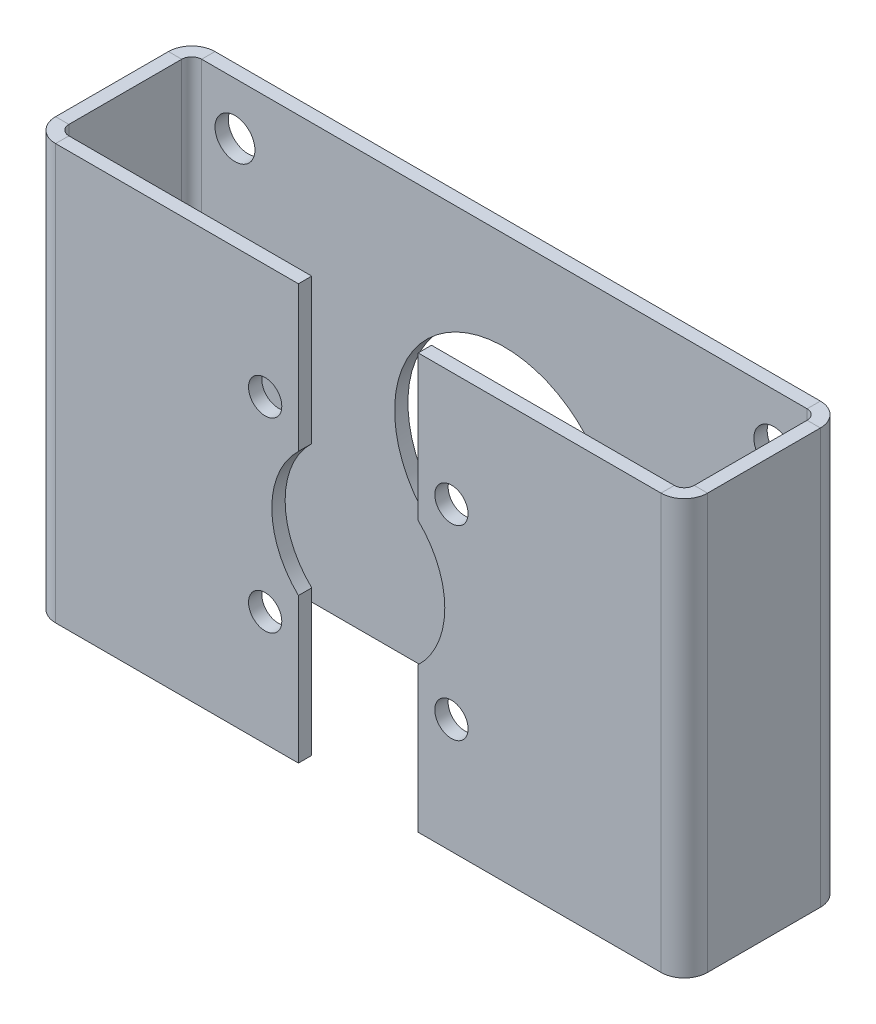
ISO-10303-21;
HEADER;
FILE_DESCRIPTION(('STEP AP214'),'2;1');
FILE_NAME('part.step','',(''),(''),'','','');
FILE_SCHEMA(('AUTOMOTIVE_DESIGN { 1 0 10303 214 1 1 1 1 }'));
ENDSEC;
DATA;
#1=APPLICATION_CONTEXT('core data for automotive mechanical design processes');
#2=APPLICATION_PROTOCOL_DEFINITION('international standard','automotive_design',2000,#1);
#3=PRODUCT_CONTEXT('',#1,'mechanical');
#4=PRODUCT('Part','Part','',(#3));
#5=PRODUCT_RELATED_PRODUCT_CATEGORY('part','',(#4));
#6=PRODUCT_DEFINITION_FORMATION('','',#4);
#7=PRODUCT_DEFINITION_CONTEXT('part definition',#1,'design');
#8=PRODUCT_DEFINITION('design','',#6,#7);
#9=PRODUCT_DEFINITION_SHAPE('','',#8);
#10=(LENGTH_UNIT() NAMED_UNIT(*) SI_UNIT(.MILLI.,.METRE.));
#11=(NAMED_UNIT(*) PLANE_ANGLE_UNIT() SI_UNIT($,.RADIAN.));
#12=(NAMED_UNIT(*) SI_UNIT($,.STERADIAN.) SOLID_ANGLE_UNIT());
#13=UNCERTAINTY_MEASURE_WITH_UNIT(LENGTH_MEASURE(1.E-05),#10,'distance_accuracy_value','');
#14=(GEOMETRIC_REPRESENTATION_CONTEXT(3) GLOBAL_UNCERTAINTY_ASSIGNED_CONTEXT((#13)) GLOBAL_UNIT_ASSIGNED_CONTEXT((#10,
#11,#12)) REPRESENTATION_CONTEXT('',''));
#15=CARTESIAN_POINT('',(0.,0.,0.));
#16=DIRECTION('',(0.,0.,1.));
#17=DIRECTION('',(1.,0.,0.));
#18=AXIS2_PLACEMENT_3D('',#15,#16,#17);
#19=CARTESIAN_POINT('',(-149.225,-99.06,76.073));
#20=DIRECTION('',(0.,0.,1.));
#21=DIRECTION('',(1.,0.,0.));
#22=AXIS2_PLACEMENT_3D('',#19,#20,#21);
#23=PLANE('',#22);
#24=CARTESIAN_POINT('',(-44.4500000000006,44.45,76.0730000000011));
#25=DIRECTION('',(0.,0.,1.));
#26=DIRECTION('',(1.,0.,0.));
#27=AXIS2_PLACEMENT_3D('',#24,#25,#26);
#28=CIRCLE('',#27,7.9375);
#29=CARTESIAN_POINT('',(-36.5125000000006,44.45,76.0730000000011));
#30=VERTEX_POINT('',#29);
#31=EDGE_CURVE('E615',#30,#30,#28,.T.);
#32=ORIENTED_EDGE('',*,*,#31,.F.);
#33=EDGE_LOOP('',(#32));
#34=FACE_BOUND('',#33,.T.);
#35=CARTESIAN_POINT('',(-44.4500000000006,-44.45,76.0730000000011));
#36=DIRECTION('',(0.,0.,1.));
#37=DIRECTION('',(1.,0.,0.));
#38=AXIS2_PLACEMENT_3D('',#35,#36,#37);
#39=CIRCLE('',#38,7.9375);
#40=CARTESIAN_POINT('',(-36.5125000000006,-44.45,76.0730000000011));
#41=VERTEX_POINT('',#40);
#42=EDGE_CURVE('E621',#41,#41,#39,.T.);
#43=ORIENTED_EDGE('',*,*,#42,.F.);
#44=EDGE_LOOP('',(#43));
#45=FACE_BOUND('',#44,.T.);
#46=DIRECTION('',(0.,-1.,0.));
#47=VECTOR('',#46,1.);
#48=CARTESIAN_POINT('',(-28.5750000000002,-99.06,76.0730000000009));
#49=LINE('',#48,#47);
#50=CARTESIAN_POINT('',(-28.5750000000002,-99.06,76.0730000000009));
#51=VERTEX_POINT('',#50);
#52=CARTESIAN_POINT('',(-28.5750000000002,-29.784140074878,76.0730000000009));
#53=VERTEX_POINT('',#52);
#54=EDGE_CURVE('E470',#51,#53,#49,.F.);
#55=ORIENTED_EDGE('',*,*,#54,.T.);
#56=CARTESIAN_POINT('',(5.53095581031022E-13,0.,76.0730000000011));
#57=DIRECTION('',(0.,0.,1.));
#58=DIRECTION('',(1.,0.,0.));
#59=AXIS2_PLACEMENT_3D('',#56,#57,#58);
#60=CIRCLE('',#59,41.275);
#61=CARTESIAN_POINT('',(-28.5750000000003,29.7841400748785,76.0730000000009));
#62=VERTEX_POINT('',#61);
#63=EDGE_CURVE('E275',#62,#53,#60,.T.);
#64=ORIENTED_EDGE('',*,*,#63,.F.);
#65=CARTESIAN_POINT('',(-28.5750000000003,99.0600000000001,76.0730000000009));
#66=VERTEX_POINT('',#65);
#67=EDGE_CURVE('E471',#62,#66,#49,.F.);
#68=ORIENTED_EDGE('',*,*,#67,.T.);
#69=DIRECTION('',(1.,0.,0.));
#70=VECTOR('',#69,1.);
#71=CARTESIAN_POINT('',(-149.225,99.06,76.073));
#72=LINE('',#71,#70);
#73=CARTESIAN_POINT('',(-144.4625,99.06,76.073));
#74=VERTEX_POINT('',#73);
#75=EDGE_CURVE('E467',#66,#74,#72,.F.);
#76=ORIENTED_EDGE('',*,*,#75,.T.);
#77=DIRECTION('',(0.,-1.,0.));
#78=VECTOR('',#77,1.);
#79=CARTESIAN_POINT('',(-144.4625,-99.06,76.073));
#80=LINE('',#79,#78);
#81=CARTESIAN_POINT('',(-144.4625,-99.06,76.073));
#82=VERTEX_POINT('',#81);
#83=EDGE_CURVE('E304',#74,#82,#80,.T.);
#84=ORIENTED_EDGE('',*,*,#83,.T.);
#85=DIRECTION('',(-1.,0.,0.));
#86=VECTOR('',#85,1.);
#87=CARTESIAN_POINT('',(-149.225,-99.06,76.073));
#88=LINE('',#87,#86);
#89=EDGE_CURVE('E298',#82,#51,#88,.F.);
#90=ORIENTED_EDGE('',*,*,#89,.T.);
#91=EDGE_LOOP('',(#55,#64,#68,#76,#84,#90));
#92=FACE_BOUND('',#91,.T.);
#93=ADVANCED_FACE('F112',(#34,#45,#92),#23,.T.);
#94=CARTESIAN_POINT('',(-149.225,-99.06,69.723));
#95=DIRECTION('',(0.,0.,1.));
#96=DIRECTION('',(1.,0.,0.));
#97=AXIS2_PLACEMENT_3D('',#94,#95,#96);
#98=PLANE('',#97);
#99=CARTESIAN_POINT('',(-44.4500000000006,44.45,69.7230000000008));
#100=DIRECTION('',(0.,0.,1.));
#101=DIRECTION('',(1.,0.,0.));
#102=AXIS2_PLACEMENT_3D('',#99,#100,#101);
#103=CIRCLE('',#102,7.9375);
#104=CARTESIAN_POINT('',(-36.5125000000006,44.45,69.7230000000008));
#105=VERTEX_POINT('',#104);
#106=EDGE_CURVE('E582',#105,#105,#103,.F.);
#107=ORIENTED_EDGE('',*,*,#106,.F.);
#108=EDGE_LOOP('',(#107));
#109=FACE_BOUND('',#108,.T.);
#110=CARTESIAN_POINT('',(-44.4500000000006,-44.45,69.7230000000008));
#111=DIRECTION('',(0.,0.,1.));
#112=DIRECTION('',(1.,0.,0.));
#113=AXIS2_PLACEMENT_3D('',#110,#111,#112);
#114=CIRCLE('',#113,7.9375);
#115=CARTESIAN_POINT('',(-36.5125000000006,-44.45,69.7230000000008));
#116=VERTEX_POINT('',#115);
#117=EDGE_CURVE('E618',#116,#116,#114,.F.);
#118=ORIENTED_EDGE('',*,*,#117,.F.);
#119=EDGE_LOOP('',(#118));
#120=FACE_BOUND('',#119,.T.);
#121=CARTESIAN_POINT('',(5.98380993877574E-13,0.,69.7230000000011));
#122=DIRECTION('',(0.,0.,1.));
#123=DIRECTION('',(1.,0.,0.));
#124=AXIS2_PLACEMENT_3D('',#121,#122,#123);
#125=CIRCLE('',#124,41.275);
#126=CARTESIAN_POINT('',(-28.5750000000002,29.7841400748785,69.7230000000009));
#127=VERTEX_POINT('',#126);
#128=CARTESIAN_POINT('',(-28.5750000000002,-29.784140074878,69.7230000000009));
#129=VERTEX_POINT('',#128);
#130=EDGE_CURVE('E129',#127,#129,#125,.T.);
#131=ORIENTED_EDGE('',*,*,#130,.T.);
#132=DIRECTION('',(0.,1.,0.));
#133=VECTOR('',#132,1.);
#134=CARTESIAN_POINT('',(-28.5750000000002,-99.06,69.7230000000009));
#135=LINE('',#134,#133);
#136=CARTESIAN_POINT('',(-28.5750000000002,-99.06,69.7230000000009));
#137=VERTEX_POINT('',#136);
#138=EDGE_CURVE('E287',#137,#129,#135,.T.);
#139=ORIENTED_EDGE('',*,*,#138,.F.);
#140=DIRECTION('',(1.,0.,0.));
#141=VECTOR('',#140,1.);
#142=CARTESIAN_POINT('',(-149.225,-99.06,69.723));
#143=LINE('',#142,#141);
#144=CARTESIAN_POINT('',(-144.4625,-99.06,69.723));
#145=VERTEX_POINT('',#144);
#146=EDGE_CURVE('E300',#145,#137,#143,.T.);
#147=ORIENTED_EDGE('',*,*,#146,.F.);
#148=DIRECTION('',(0.,1.,0.));
#149=VECTOR('',#148,1.);
#150=CARTESIAN_POINT('',(-144.4625,99.06,69.723));
#151=LINE('',#150,#149);
#152=CARTESIAN_POINT('',(-144.4625,99.06,69.723));
#153=VERTEX_POINT('',#152);
#154=EDGE_CURVE('E310',#153,#145,#151,.F.);
#155=ORIENTED_EDGE('',*,*,#154,.F.);
#156=DIRECTION('',(-1.,0.,0.));
#157=VECTOR('',#156,1.);
#158=CARTESIAN_POINT('',(-28.5750000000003,99.06,69.7230000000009));
#159=LINE('',#158,#157);
#160=CARTESIAN_POINT('',(-28.5750000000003,99.06,69.7230000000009));
#161=VERTEX_POINT('',#160);
#162=EDGE_CURVE('E295',#161,#153,#159,.T.);
#163=ORIENTED_EDGE('',*,*,#162,.F.);
#164=EDGE_CURVE('E289',#127,#161,#135,.T.);
#165=ORIENTED_EDGE('',*,*,#164,.F.);
#166=EDGE_LOOP('',(#131,#139,#147,#155,#163,#165));
#167=FACE_BOUND('',#166,.T.);
#168=ADVANCED_FACE('F285',(#109,#120,#167),#98,.F.);
#169=CARTESIAN_POINT('',(-28.5750000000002,-99.06,76.0730000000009));
#170=DIRECTION('',(-1.,0.,0.));
#171=DIRECTION('',(0.,0.,1.));
#172=AXIS2_PLACEMENT_3D('',#169,#170,#171);
#173=PLANE('',#172);
#174=DIRECTION('',(0.,0.,1.));
#175=VECTOR('',#174,1.);
#176=CARTESIAN_POINT('',(-28.5750000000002,-29.784140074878,76.0730000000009));
#177=LINE('',#176,#175);
#178=EDGE_CURVE('E272',#53,#129,#177,.F.);
#179=ORIENTED_EDGE('',*,*,#178,.F.);
#180=ORIENTED_EDGE('',*,*,#54,.F.);
#181=DIRECTION('',(0.,0.,-1.));
#182=VECTOR('',#181,1.);
#183=CARTESIAN_POINT('',(-28.5750000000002,-99.06,76.0730000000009));
#184=LINE('',#183,#182);
#185=EDGE_CURVE('E294',#51,#137,#184,.T.);
#186=ORIENTED_EDGE('',*,*,#185,.T.);
#187=ORIENTED_EDGE('',*,*,#138,.T.);
#188=EDGE_LOOP('',(#179,#180,#186,#187));
#189=FACE_BOUND('',#188,.T.);
#190=ADVANCED_FACE('F292',(#189),#173,.F.);
#191=DIRECTION('',(0.,0.,1.));
#192=VECTOR('',#191,1.);
#193=CARTESIAN_POINT('',(-28.5750000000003,29.7841400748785,76.0730000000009));
#194=LINE('',#193,#192);
#195=EDGE_CURVE('E280',#62,#127,#194,.F.);
#196=ORIENTED_EDGE('',*,*,#195,.T.);
#197=ORIENTED_EDGE('',*,*,#164,.T.);
#198=DIRECTION('',(0.,0.,-1.));
#199=VECTOR('',#198,1.);
#200=CARTESIAN_POINT('',(-28.5750000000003,99.06,76.0730000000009));
#201=LINE('',#200,#199);
#202=EDGE_CURVE('E464',#66,#161,#201,.T.);
#203=ORIENTED_EDGE('',*,*,#202,.F.);
#204=ORIENTED_EDGE('',*,*,#67,.F.);
#205=EDGE_LOOP('',(#196,#197,#203,#204));
#206=FACE_BOUND('',#205,.T.);
#207=ADVANCED_FACE('F478',(#206),#173,.F.);
#208=CARTESIAN_POINT('',(149.225,-99.06,76.073));
#209=DIRECTION('',(0.,0.,1.));
#210=DIRECTION('',(-1.,0.,0.));
#211=AXIS2_PLACEMENT_3D('',#208,#209,#210);
#212=PLANE('',#211);
#213=CARTESIAN_POINT('',(44.4499999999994,44.45,76.0730000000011));
#214=DIRECTION('',(0.,0.,1.));
#215=DIRECTION('',(1.,0.,0.));
#216=AXIS2_PLACEMENT_3D('',#213,#214,#215);
#217=CIRCLE('',#216,7.9375);
#218=CARTESIAN_POINT('',(52.3874999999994,44.45,76.0730000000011));
#219=VERTEX_POINT('',#218);
#220=EDGE_CURVE('E627',#219,#219,#217,.T.);
#221=ORIENTED_EDGE('',*,*,#220,.F.);
#222=EDGE_LOOP('',(#221));
#223=FACE_BOUND('',#222,.T.);
#224=CARTESIAN_POINT('',(44.4499999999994,-44.45,76.0730000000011));
#225=DIRECTION('',(0.,0.,1.));
#226=DIRECTION('',(1.,0.,0.));
#227=AXIS2_PLACEMENT_3D('',#224,#225,#226);
#228=CIRCLE('',#227,7.9375);
#229=CARTESIAN_POINT('',(52.3874999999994,-44.45,76.0730000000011));
#230=VERTEX_POINT('',#229);
#231=EDGE_CURVE('E633',#230,#230,#228,.T.);
#232=ORIENTED_EDGE('',*,*,#231,.F.);
#233=EDGE_LOOP('',(#232));
#234=FACE_BOUND('',#233,.T.);
#235=DIRECTION('',(0.,1.,0.));
#236=VECTOR('',#235,1.);
#237=CARTESIAN_POINT('',(28.5750000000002,-99.06,76.0730000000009));
#238=LINE('',#237,#236);
#239=CARTESIAN_POINT('',(28.5750000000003,29.7841400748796,76.0730000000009));
#240=VERTEX_POINT('',#239);
#241=CARTESIAN_POINT('',(28.5750000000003,99.06,76.0730000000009));
#242=VERTEX_POINT('',#241);
#243=EDGE_CURVE('E602',#240,#242,#238,.T.);
#244=ORIENTED_EDGE('',*,*,#243,.F.);
#245=CARTESIAN_POINT('',(5.53095581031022E-13,0.,76.0730000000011));
#246=DIRECTION('',(0.,0.,1.));
#247=DIRECTION('',(1.,0.,0.));
#248=AXIS2_PLACEMENT_3D('',#245,#246,#247);
#249=CIRCLE('',#248,41.275);
#250=CARTESIAN_POINT('',(28.5750000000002,-29.7841400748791,76.0730000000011));
#251=VERTEX_POINT('',#250);
#252=EDGE_CURVE('E137',#251,#240,#249,.T.);
#253=ORIENTED_EDGE('',*,*,#252,.F.);
#254=CARTESIAN_POINT('',(28.5750000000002,-99.06,76.0730000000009));
#255=VERTEX_POINT('',#254);
#256=EDGE_CURVE('E603',#255,#251,#238,.T.);
#257=ORIENTED_EDGE('',*,*,#256,.F.);
#258=DIRECTION('',(-1.,0.,0.));
#259=VECTOR('',#258,1.);
#260=CARTESIAN_POINT('',(149.225,-99.06,76.073));
#261=LINE('',#260,#259);
#262=CARTESIAN_POINT('',(144.4625,-99.0599999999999,76.073));
#263=VERTEX_POINT('',#262);
#264=EDGE_CURVE('E606',#263,#255,#261,.T.);
#265=ORIENTED_EDGE('',*,*,#264,.F.);
#266=DIRECTION('',(0.,1.,0.));
#267=VECTOR('',#266,1.);
#268=CARTESIAN_POINT('',(144.4625,-99.06,76.073));
#269=LINE('',#268,#267);
#270=CARTESIAN_POINT('',(144.4625,99.06,76.073));
#271=VERTEX_POINT('',#270);
#272=EDGE_CURVE('E587',#263,#271,#269,.T.);
#273=ORIENTED_EDGE('',*,*,#272,.T.);
#274=DIRECTION('',(1.,0.,0.));
#275=VECTOR('',#274,1.);
#276=CARTESIAN_POINT('',(28.5750000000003,99.06,76.0730000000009));
#277=LINE('',#276,#275);
#278=EDGE_CURVE('E599',#242,#271,#277,.T.);
#279=ORIENTED_EDGE('',*,*,#278,.F.);
#280=EDGE_LOOP('',(#244,#253,#257,#265,#273,#279));
#281=FACE_BOUND('',#280,.T.);
#282=ADVANCED_FACE('F672',(#223,#234,#281),#212,.T.);
#283=CARTESIAN_POINT('',(149.225,-99.06,69.723));
#284=DIRECTION('',(0.,0.,1.));
#285=DIRECTION('',(-1.,0.,0.));
#286=AXIS2_PLACEMENT_3D('',#283,#284,#285);
#287=PLANE('',#286);
#288=CARTESIAN_POINT('',(44.4499999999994,44.45,69.7230000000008));
#289=DIRECTION('',(0.,0.,1.));
#290=DIRECTION('',(1.,0.,0.));
#291=AXIS2_PLACEMENT_3D('',#288,#289,#290);
#292=CIRCLE('',#291,7.9375);
#293=CARTESIAN_POINT('',(52.3874999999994,44.45,69.7230000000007));
#294=VERTEX_POINT('',#293);
#295=EDGE_CURVE('E624',#294,#294,#292,.F.);
#296=ORIENTED_EDGE('',*,*,#295,.F.);
#297=EDGE_LOOP('',(#296));
#298=FACE_BOUND('',#297,.T.);
#299=CARTESIAN_POINT('',(44.4499999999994,-44.45,69.7230000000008));
#300=DIRECTION('',(0.,0.,1.));
#301=DIRECTION('',(1.,0.,0.));
#302=AXIS2_PLACEMENT_3D('',#299,#300,#301);
#303=CIRCLE('',#302,7.9375);
#304=CARTESIAN_POINT('',(52.3874999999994,-44.45,69.7230000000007));
#305=VERTEX_POINT('',#304);
#306=EDGE_CURVE('E630',#305,#305,#303,.F.);
#307=ORIENTED_EDGE('',*,*,#306,.F.);
#308=EDGE_LOOP('',(#307));
#309=FACE_BOUND('',#308,.T.);
#310=CARTESIAN_POINT('',(5.07810168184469E-13,0.,69.7230000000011));
#311=DIRECTION('',(0.,0.,1.));
#312=DIRECTION('',(1.,0.,0.));
#313=AXIS2_PLACEMENT_3D('',#310,#311,#312);
#314=CIRCLE('',#313,41.275);
#315=CARTESIAN_POINT('',(28.5750000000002,-29.7841400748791,69.7230000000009));
#316=VERTEX_POINT('',#315);
#317=CARTESIAN_POINT('',(28.5750000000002,29.7841400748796,69.7230000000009));
#318=VERTEX_POINT('',#317);
#319=EDGE_CURVE('E640',#316,#318,#314,.T.);
#320=ORIENTED_EDGE('',*,*,#319,.T.);
#321=DIRECTION('',(0.,-1.,0.));
#322=VECTOR('',#321,1.);
#323=CARTESIAN_POINT('',(28.5750000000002,-99.06,69.7230000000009));
#324=LINE('',#323,#322);
#325=CARTESIAN_POINT('',(28.5750000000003,99.0600000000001,69.7230000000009));
#326=VERTEX_POINT('',#325);
#327=EDGE_CURVE('E593',#318,#326,#324,.F.);
#328=ORIENTED_EDGE('',*,*,#327,.T.);
#329=DIRECTION('',(-1.,0.,0.));
#330=VECTOR('',#329,1.);
#331=CARTESIAN_POINT('',(149.225,99.06,69.723));
#332=LINE('',#331,#330);
#333=CARTESIAN_POINT('',(144.4625,99.06,69.723));
#334=VERTEX_POINT('',#333);
#335=EDGE_CURVE('E590',#326,#334,#332,.F.);
#336=ORIENTED_EDGE('',*,*,#335,.T.);
#337=DIRECTION('',(0.,-1.,0.));
#338=VECTOR('',#337,1.);
#339=CARTESIAN_POINT('',(144.4625,-99.06,69.723));
#340=LINE('',#339,#338);
#341=CARTESIAN_POINT('',(144.4625,-99.06,69.723));
#342=VERTEX_POINT('',#341);
#343=EDGE_CURVE('E581',#342,#334,#340,.F.);
#344=ORIENTED_EDGE('',*,*,#343,.F.);
#345=DIRECTION('',(1.,0.,0.));
#346=VECTOR('',#345,1.);
#347=CARTESIAN_POINT('',(149.225,-99.06,69.723));
#348=LINE('',#347,#346);
#349=CARTESIAN_POINT('',(28.5750000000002,-99.06,69.7230000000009));
#350=VERTEX_POINT('',#349);
#351=EDGE_CURVE('E597',#342,#350,#348,.F.);
#352=ORIENTED_EDGE('',*,*,#351,.T.);
#353=EDGE_CURVE('E594',#350,#316,#324,.F.);
#354=ORIENTED_EDGE('',*,*,#353,.T.);
#355=EDGE_LOOP('',(#320,#328,#336,#344,#352,#354));
#356=FACE_BOUND('',#355,.T.);
#357=ADVANCED_FACE('F648',(#298,#309,#356),#287,.F.);
#358=CARTESIAN_POINT('',(28.5750000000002,-99.06,76.0730000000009));
#359=DIRECTION('',(-1.,0.,0.));
#360=DIRECTION('',(0.,0.,1.));
#361=AXIS2_PLACEMENT_3D('',#358,#359,#360);
#362=PLANE('',#361);
#363=ORIENTED_EDGE('',*,*,#256,.T.);
#364=DIRECTION('',(0.,0.,1.));
#365=VECTOR('',#364,1.);
#366=CARTESIAN_POINT('',(28.5750000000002,-29.7841400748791,76.0730000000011));
#367=LINE('',#366,#365);
#368=EDGE_CURVE('E637',#251,#316,#367,.F.);
#369=ORIENTED_EDGE('',*,*,#368,.T.);
#370=ORIENTED_EDGE('',*,*,#353,.F.);
#371=DIRECTION('',(0.,0.,-1.));
#372=VECTOR('',#371,1.);
#373=CARTESIAN_POINT('',(28.5750000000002,-99.06,76.0730000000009));
#374=LINE('',#373,#372);
#375=EDGE_CURVE('E608',#255,#350,#374,.T.);
#376=ORIENTED_EDGE('',*,*,#375,.F.);
#377=EDGE_LOOP('',(#363,#369,#370,#376));
#378=FACE_BOUND('',#377,.T.);
#379=ADVANCED_FACE('F669',(#378),#362,.T.);
#380=ORIENTED_EDGE('',*,*,#327,.F.);
#381=DIRECTION('',(0.,0.,1.));
#382=VECTOR('',#381,1.);
#383=CARTESIAN_POINT('',(28.5750000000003,29.7841400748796,76.0730000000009));
#384=LINE('',#383,#382);
#385=EDGE_CURVE('E636',#240,#318,#384,.F.);
#386=ORIENTED_EDGE('',*,*,#385,.F.);
#387=ORIENTED_EDGE('',*,*,#243,.T.);
#388=DIRECTION('',(0.,0.,-1.));
#389=VECTOR('',#388,1.);
#390=CARTESIAN_POINT('',(28.5750000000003,99.06,76.0730000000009));
#391=LINE('',#390,#389);
#392=EDGE_CURVE('E565',#242,#326,#391,.T.);
#393=ORIENTED_EDGE('',*,*,#392,.T.);
#394=EDGE_LOOP('',(#380,#386,#387,#393));
#395=FACE_BOUND('',#394,.T.);
#396=ADVANCED_FACE('F651',(#395),#362,.T.);
#397=CARTESIAN_POINT('',(155.575,99.06,76.073));
#398=DIRECTION('',(0.,-1.,0.));
#399=DIRECTION('',(1.,0.,0.));
#400=AXIS2_PLACEMENT_3D('',#397,#398,#399);
#401=PLANE('',#400);
#402=DIRECTION('',(1.,0.,0.));
#403=VECTOR('',#402,1.);
#404=CARTESIAN_POINT('',(149.225,99.06,64.9605));
#405=LINE('',#404,#403);
#406=CARTESIAN_POINT('',(149.225,99.06,64.9605));
#407=VERTEX_POINT('',#406);
#408=CARTESIAN_POINT('',(155.575,99.06,64.9605));
#409=VERTEX_POINT('',#408);
#410=EDGE_CURVE('E555',#407,#409,#405,.T.);
#411=ORIENTED_EDGE('',*,*,#410,.T.);
#412=DIRECTION('',(0.,0.,-1.));
#413=VECTOR('',#412,1.);
#414=CARTESIAN_POINT('',(155.575,99.06,6.34999999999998));
#415=LINE('',#414,#413);
#416=CARTESIAN_POINT('',(155.575,99.06,11.1124999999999));
#417=VERTEX_POINT('',#416);
#418=EDGE_CURVE('E459',#417,#409,#415,.F.);
#419=ORIENTED_EDGE('',*,*,#418,.F.);
#420=DIRECTION('',(-1.,0.,0.));
#421=VECTOR('',#420,1.);
#422=CARTESIAN_POINT('',(149.225,99.06,11.1125));
#423=LINE('',#422,#421);
#424=CARTESIAN_POINT('',(149.225,99.06,11.1125));
#425=VERTEX_POINT('',#424);
#426=EDGE_CURVE('E541',#425,#417,#423,.F.);
#427=ORIENTED_EDGE('',*,*,#426,.F.);
#428=DIRECTION('',(0.,0.,1.));
#429=VECTOR('',#428,1.);
#430=CARTESIAN_POINT('',(149.225,99.06,76.073));
#431=LINE('',#430,#429);
#432=EDGE_CURVE('E539',#425,#407,#431,.T.);
#433=ORIENTED_EDGE('',*,*,#432,.T.);
#434=EDGE_LOOP('',(#411,#419,#427,#433));
#435=FACE_BOUND('',#434,.T.);
#436=ADVANCED_FACE('F686',(#435),#401,.F.);
#437=CARTESIAN_POINT('',(155.575,-99.06,6.34999999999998));
#438=DIRECTION('',(0.,1.,0.));
#439=DIRECTION('',(-1.,0.,0.));
#440=AXIS2_PLACEMENT_3D('',#437,#438,#439);
#441=PLANE('',#440);
#442=DIRECTION('',(1.,0.,0.));
#443=VECTOR('',#442,1.);
#444=CARTESIAN_POINT('',(149.225,-99.06,64.9605));
#445=LINE('',#444,#443);
#446=CARTESIAN_POINT('',(149.225,-99.06,64.9605));
#447=VERTEX_POINT('',#446);
#448=CARTESIAN_POINT('',(155.575,-99.06,64.9605));
#449=VERTEX_POINT('',#448);
#450=EDGE_CURVE('E545',#447,#449,#445,.T.);
#451=ORIENTED_EDGE('',*,*,#450,.F.);
#452=DIRECTION('',(0.,0.,-1.));
#453=VECTOR('',#452,1.);
#454=CARTESIAN_POINT('',(149.225,-99.06,6.35));
#455=LINE('',#454,#453);
#456=CARTESIAN_POINT('',(149.225,-99.06,11.1125));
#457=VERTEX_POINT('',#456);
#458=EDGE_CURVE('E536',#447,#457,#455,.T.);
#459=ORIENTED_EDGE('',*,*,#458,.T.);
#460=DIRECTION('',(-1.,0.,0.));
#461=VECTOR('',#460,1.);
#462=CARTESIAN_POINT('',(155.575,-99.06,11.1124999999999));
#463=LINE('',#462,#461);
#464=CARTESIAN_POINT('',(155.575,-99.06,11.1124999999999));
#465=VERTEX_POINT('',#464);
#466=EDGE_CURVE('E449',#457,#465,#463,.F.);
#467=ORIENTED_EDGE('',*,*,#466,.T.);
#468=DIRECTION('',(0.,0.,1.));
#469=VECTOR('',#468,1.);
#470=CARTESIAN_POINT('',(155.575,-99.06,6.34999999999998));
#471=LINE('',#470,#469);
#472=EDGE_CURVE('E551',#449,#465,#471,.F.);
#473=ORIENTED_EDGE('',*,*,#472,.F.);
#474=EDGE_LOOP('',(#451,#459,#467,#473));
#475=FACE_BOUND('',#474,.T.);
#476=ADVANCED_FACE('F684',(#475),#441,.F.);
#477=CARTESIAN_POINT('',(155.575,-99.06,6.34999999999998));
#478=DIRECTION('',(1.,0.,0.));
#479=DIRECTION('',(0.,0.,1.));
#480=AXIS2_PLACEMENT_3D('',#477,#478,#479);
#481=PLANE('',#480);
#482=ORIENTED_EDGE('',*,*,#418,.T.);
#483=DIRECTION('',(0.,1.,0.));
#484=VECTOR('',#483,1.);
#485=CARTESIAN_POINT('',(155.575,99.06,64.9605));
#486=LINE('',#485,#484);
#487=EDGE_CURVE('E573',#409,#449,#486,.F.);
#488=ORIENTED_EDGE('',*,*,#487,.T.);
#489=ORIENTED_EDGE('',*,*,#472,.T.);
#490=DIRECTION('',(0.,1.,0.));
#491=VECTOR('',#490,1.);
#492=CARTESIAN_POINT('',(155.575,-99.06,11.1124999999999));
#493=LINE('',#492,#491);
#494=EDGE_CURVE('E543',#465,#417,#493,.T.);
#495=ORIENTED_EDGE('',*,*,#494,.T.);
#496=EDGE_LOOP('',(#482,#488,#489,#495));
#497=FACE_BOUND('',#496,.T.);
#498=ADVANCED_FACE('F681',(#497),#481,.T.);
#499=CARTESIAN_POINT('',(149.225,-99.06,6.35));
#500=DIRECTION('',(1.,0.,0.));
#501=DIRECTION('',(0.,0.,1.));
#502=AXIS2_PLACEMENT_3D('',#499,#500,#501);
#503=PLANE('',#502);
#504=DIRECTION('',(0.,1.,0.));
#505=VECTOR('',#504,1.);
#506=CARTESIAN_POINT('',(149.225,99.06,64.9605));
#507=LINE('',#506,#505);
#508=EDGE_CURVE('E564',#407,#447,#507,.F.);
#509=ORIENTED_EDGE('',*,*,#508,.F.);
#510=ORIENTED_EDGE('',*,*,#432,.F.);
#511=DIRECTION('',(0.,-1.,0.));
#512=VECTOR('',#511,1.);
#513=CARTESIAN_POINT('',(149.225,-99.06,11.1125));
#514=LINE('',#513,#512);
#515=EDGE_CURVE('E529',#457,#425,#514,.F.);
#516=ORIENTED_EDGE('',*,*,#515,.F.);
#517=ORIENTED_EDGE('',*,*,#458,.F.);
#518=EDGE_LOOP('',(#509,#510,#516,#517));
#519=FACE_BOUND('',#518,.T.);
#520=ADVANCED_FACE('F535',(#519),#503,.F.);
#521=CARTESIAN_POINT('',(155.575,-99.06,6.35));
#522=DIRECTION('',(0.,0.,-1.));
#523=DIRECTION('',(-1.,0.,0.));
#524=AXIS2_PLACEMENT_3D('',#521,#522,#523);
#525=PLANE('',#524);
#526=CARTESIAN_POINT('',(128.5875,74.2061,6.35));
#527=DIRECTION('',(0.,0.,1.));
#528=DIRECTION('',(1.,0.,0.));
#529=AXIS2_PLACEMENT_3D('',#526,#527,#528);
#530=CIRCLE('',#529,9.525);
#531=CARTESIAN_POINT('',(138.1125,74.2061,6.35));
#532=VERTEX_POINT('',#531);
#533=EDGE_CURVE('E392',#532,#532,#530,.T.);
#534=ORIENTED_EDGE('',*,*,#533,.F.);
#535=EDGE_LOOP('',(#534));
#536=FACE_BOUND('',#535,.T.);
#537=CARTESIAN_POINT('',(-128.5875,74.2061,6.35));
#538=DIRECTION('',(0.,0.,1.));
#539=DIRECTION('',(1.,0.,0.));
#540=AXIS2_PLACEMENT_3D('',#537,#538,#539);
#541=CIRCLE('',#540,9.52500000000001);
#542=CARTESIAN_POINT('',(-119.0625,74.2061,6.35));
#543=VERTEX_POINT('',#542);
#544=EDGE_CURVE('E404',#543,#543,#541,.T.);
#545=ORIENTED_EDGE('',*,*,#544,.F.);
#546=EDGE_LOOP('',(#545));
#547=FACE_BOUND('',#546,.T.);
#548=CARTESIAN_POINT('',(0.,0.,6.35));
#549=DIRECTION('',(0.,0.,1.));
#550=DIRECTION('',(1.,0.,0.));
#551=AXIS2_PLACEMENT_3D('',#548,#549,#550);
#552=CIRCLE('',#551,52.3875);
#553=CARTESIAN_POINT('',(52.3875,0.,6.35));
#554=VERTEX_POINT('',#553);
#555=EDGE_CURVE('E410',#554,#554,#552,.T.);
#556=ORIENTED_EDGE('',*,*,#555,.F.);
#557=EDGE_LOOP('',(#556));
#558=FACE_BOUND('',#557,.T.);
#559=CARTESIAN_POINT('',(-128.5875,-74.2061,6.35));
#560=DIRECTION('',(0.,0.,1.));
#561=DIRECTION('',(1.,0.,0.));
#562=AXIS2_PLACEMENT_3D('',#559,#560,#561);
#563=CIRCLE('',#562,9.52500000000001);
#564=CARTESIAN_POINT('',(-119.0625,-74.2061,6.35));
#565=VERTEX_POINT('',#564);
#566=EDGE_CURVE('E398',#565,#565,#563,.T.);
#567=ORIENTED_EDGE('',*,*,#566,.F.);
#568=EDGE_LOOP('',(#567));
#569=FACE_BOUND('',#568,.T.);
#570=CARTESIAN_POINT('',(128.5875,-74.2061,6.35));
#571=DIRECTION('',(0.,0.,1.));
#572=DIRECTION('',(1.,0.,0.));
#573=AXIS2_PLACEMENT_3D('',#570,#571,#572);
#574=CIRCLE('',#573,9.525);
#575=CARTESIAN_POINT('',(138.1125,-74.2061,6.35));
#576=VERTEX_POINT('',#575);
#577=EDGE_CURVE('E386',#576,#576,#574,.T.);
#578=ORIENTED_EDGE('',*,*,#577,.F.);
#579=EDGE_LOOP('',(#578));
#580=FACE_BOUND('',#579,.T.);
#581=DIRECTION('',(0.,1.,0.));
#582=VECTOR('',#581,1.);
#583=CARTESIAN_POINT('',(144.4625,99.06,6.35000000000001));
#584=LINE('',#583,#582);
#585=CARTESIAN_POINT('',(144.4625,99.06,6.35000000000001));
#586=VERTEX_POINT('',#585);
#587=CARTESIAN_POINT('',(144.4625,-99.06,6.35000000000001));
#588=VERTEX_POINT('',#587);
#589=EDGE_CURVE('E454',#586,#588,#584,.F.);
#590=ORIENTED_EDGE('',*,*,#589,.F.);
#591=DIRECTION('',(-1.,0.,0.));
#592=VECTOR('',#591,1.);
#593=CARTESIAN_POINT('',(-155.575,99.06,6.35));
#594=LINE('',#593,#592);
#595=CARTESIAN_POINT('',(-144.4625,99.06,6.34999999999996));
#596=VERTEX_POINT('',#595);
#597=EDGE_CURVE('E13',#586,#596,#594,.T.);
#598=ORIENTED_EDGE('',*,*,#597,.T.);
#599=DIRECTION('',(0.,-1.,0.));
#600=VECTOR('',#599,1.);
#601=CARTESIAN_POINT('',(-144.4625,-99.06,6.34999999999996));
#602=LINE('',#601,#600);
#603=CARTESIAN_POINT('',(-144.4625,-99.06,6.34999999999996));
#604=VERTEX_POINT('',#603);
#605=EDGE_CURVE('E375',#604,#596,#602,.F.);
#606=ORIENTED_EDGE('',*,*,#605,.F.);
#607=DIRECTION('',(1.,0.,0.));
#608=VECTOR('',#607,1.);
#609=CARTESIAN_POINT('',(-155.575,-99.06,6.35));
#610=LINE('',#609,#608);
#611=EDGE_CURVE('E121',#604,#588,#610,.T.);
#612=ORIENTED_EDGE('',*,*,#611,.T.);
#613=EDGE_LOOP('',(#590,#598,#606,#612));
#614=FACE_BOUND('',#613,.T.);
#615=ADVANCED_FACE('F520',(#536,#547,#558,#569,#580,#614),#525,.F.);
#616=CARTESIAN_POINT('',(155.575,-99.06,0.));
#617=DIRECTION('',(0.,0.,-1.));
#618=DIRECTION('',(-1.,0.,0.));
#619=AXIS2_PLACEMENT_3D('',#616,#617,#618);
#620=PLANE('',#619);
#621=CARTESIAN_POINT('',(128.5875,74.2061,0.));
#622=DIRECTION('',(0.,0.,1.));
#623=DIRECTION('',(1.,0.,0.));
#624=AXIS2_PLACEMENT_3D('',#621,#622,#623);
#625=CIRCLE('',#624,9.525);
#626=CARTESIAN_POINT('',(138.1125,74.2061,0.));
#627=VERTEX_POINT('',#626);
#628=EDGE_CURVE('E389',#627,#627,#625,.T.);
#629=ORIENTED_EDGE('',*,*,#628,.T.);
#630=EDGE_LOOP('',(#629));
#631=FACE_BOUND('',#630,.T.);
#632=CARTESIAN_POINT('',(-128.5875,74.2061,0.));
#633=DIRECTION('',(0.,0.,1.));
#634=DIRECTION('',(1.,0.,0.));
#635=AXIS2_PLACEMENT_3D('',#632,#633,#634);
#636=CIRCLE('',#635,9.52500000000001);
#637=CARTESIAN_POINT('',(-119.0625,74.2061,0.));
#638=VERTEX_POINT('',#637);
#639=EDGE_CURVE('E401',#638,#638,#636,.T.);
#640=ORIENTED_EDGE('',*,*,#639,.T.);
#641=EDGE_LOOP('',(#640));
#642=FACE_BOUND('',#641,.T.);
#643=CARTESIAN_POINT('',(0.,0.,0.));
#644=DIRECTION('',(0.,0.,1.));
#645=DIRECTION('',(1.,0.,0.));
#646=AXIS2_PLACEMENT_3D('',#643,#644,#645);
#647=CIRCLE('',#646,52.3875);
#648=CARTESIAN_POINT('',(52.3875,0.,0.));
#649=VERTEX_POINT('',#648);
#650=EDGE_CURVE('E407',#649,#649,#647,.T.);
#651=ORIENTED_EDGE('',*,*,#650,.T.);
#652=EDGE_LOOP('',(#651));
#653=FACE_BOUND('',#652,.T.);
#654=CARTESIAN_POINT('',(-128.5875,-74.2061,0.));
#655=DIRECTION('',(0.,0.,1.));
#656=DIRECTION('',(1.,0.,0.));
#657=AXIS2_PLACEMENT_3D('',#654,#655,#656);
#658=CIRCLE('',#657,9.52500000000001);
#659=CARTESIAN_POINT('',(-119.0625,-74.2061,0.));
#660=VERTEX_POINT('',#659);
#661=EDGE_CURVE('E395',#660,#660,#658,.T.);
#662=ORIENTED_EDGE('',*,*,#661,.T.);
#663=EDGE_LOOP('',(#662));
#664=FACE_BOUND('',#663,.T.);
#665=CARTESIAN_POINT('',(128.5875,-74.2061,0.));
#666=DIRECTION('',(0.,0.,1.));
#667=DIRECTION('',(1.,0.,0.));
#668=AXIS2_PLACEMENT_3D('',#665,#666,#667);
#669=CIRCLE('',#668,9.525);
#670=CARTESIAN_POINT('',(138.1125,-74.2061,0.));
#671=VERTEX_POINT('',#670);
#672=EDGE_CURVE('E383',#671,#671,#669,.T.);
#673=ORIENTED_EDGE('',*,*,#672,.T.);
#674=EDGE_LOOP('',(#673));
#675=FACE_BOUND('',#674,.T.);
#676=DIRECTION('',(-1.,0.,0.));
#677=VECTOR('',#676,1.);
#678=CARTESIAN_POINT('',(-155.575,99.06,0.));
#679=LINE('',#678,#677);
#680=CARTESIAN_POINT('',(144.4625,99.06,0.));
#681=VERTEX_POINT('',#680);
#682=CARTESIAN_POINT('',(-144.4625,99.06,0.));
#683=VERTEX_POINT('',#682);
#684=EDGE_CURVE('E116',#681,#683,#679,.T.);
#685=ORIENTED_EDGE('',*,*,#684,.F.);
#686=DIRECTION('',(0.,1.,0.));
#687=VECTOR('',#686,1.);
#688=CARTESIAN_POINT('',(144.4625,99.06,0.));
#689=LINE('',#688,#687);
#690=CARTESIAN_POINT('',(144.4625,-99.06,0.));
#691=VERTEX_POINT('',#690);
#692=EDGE_CURVE('E438',#681,#691,#689,.F.);
#693=ORIENTED_EDGE('',*,*,#692,.T.);
#694=DIRECTION('',(1.,0.,0.));
#695=VECTOR('',#694,1.);
#696=CARTESIAN_POINT('',(-155.575,-99.06,0.));
#697=LINE('',#696,#695);
#698=CARTESIAN_POINT('',(-144.4625,-99.06,0.));
#699=VERTEX_POINT('',#698);
#700=EDGE_CURVE('E413',#699,#691,#697,.T.);
#701=ORIENTED_EDGE('',*,*,#700,.F.);
#702=DIRECTION('',(0.,-1.,0.));
#703=VECTOR('',#702,1.);
#704=CARTESIAN_POINT('',(-144.4625,-99.06,0.));
#705=LINE('',#704,#703);
#706=EDGE_CURVE('E362',#699,#683,#705,.F.);
#707=ORIENTED_EDGE('',*,*,#706,.T.);
#708=EDGE_LOOP('',(#685,#693,#701,#707));
#709=FACE_BOUND('',#708,.T.);
#710=ADVANCED_FACE('F437',(#631,#642,#653,#664,#675,#709),#620,.T.);
#711=CARTESIAN_POINT('',(-155.575,-99.06,6.35));
#712=DIRECTION('',(0.,1.,0.));
#713=DIRECTION('',(-1.,0.,0.));
#714=AXIS2_PLACEMENT_3D('',#711,#712,#713);
#715=PLANE('',#714);
#716=DIRECTION('',(0.,0.,-1.));
#717=VECTOR('',#716,1.);
#718=CARTESIAN_POINT('',(144.4625,-99.06,6.35000000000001));
#719=LINE('',#718,#717);
#720=EDGE_CURVE('E315',#588,#691,#719,.T.);
#721=ORIENTED_EDGE('',*,*,#720,.F.);
#722=ORIENTED_EDGE('',*,*,#611,.F.);
#723=DIRECTION('',(0.,0.,-1.));
#724=VECTOR('',#723,1.);
#725=CARTESIAN_POINT('',(-144.4625,-99.06,6.34999999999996));
#726=LINE('',#725,#724);
#727=EDGE_CURVE('E369',#604,#699,#726,.T.);
#728=ORIENTED_EDGE('',*,*,#727,.T.);
#729=ORIENTED_EDGE('',*,*,#700,.T.);
#730=EDGE_LOOP('',(#721,#722,#728,#729));
#731=FACE_BOUND('',#730,.T.);
#732=ADVANCED_FACE('F114',(#731),#715,.F.);
#733=CARTESIAN_POINT('',(-155.575,99.06,6.35));
#734=DIRECTION('',(0.,-1.,0.));
#735=DIRECTION('',(1.,0.,0.));
#736=AXIS2_PLACEMENT_3D('',#733,#734,#735);
#737=PLANE('',#736);
#738=DIRECTION('',(0.,0.,-1.));
#739=VECTOR('',#738,1.);
#740=CARTESIAN_POINT('',(144.4625,99.06,6.35000000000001));
#741=LINE('',#740,#739);
#742=EDGE_CURVE('E428',#586,#681,#741,.T.);
#743=ORIENTED_EDGE('',*,*,#742,.T.);
#744=ORIENTED_EDGE('',*,*,#684,.T.);
#745=DIRECTION('',(0.,0.,-1.));
#746=VECTOR('',#745,1.);
#747=CARTESIAN_POINT('',(-144.4625,99.06,6.34999999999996));
#748=LINE('',#747,#746);
#749=EDGE_CURVE('E380',#596,#683,#748,.T.);
#750=ORIENTED_EDGE('',*,*,#749,.F.);
#751=ORIENTED_EDGE('',*,*,#597,.F.);
#752=EDGE_LOOP('',(#743,#744,#750,#751));
#753=FACE_BOUND('',#752,.T.);
#754=ADVANCED_FACE('F426',(#753),#737,.F.);
#755=CARTESIAN_POINT('',(-155.575,-99.06,6.34999999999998));
#756=DIRECTION('',(0.,-1.,0.));
#757=DIRECTION('',(1.,0.,0.));
#758=AXIS2_PLACEMENT_3D('',#755,#756,#757);
#759=PLANE('',#758);
#760=DIRECTION('',(0.,0.,1.));
#761=VECTOR('',#760,1.);
#762=CARTESIAN_POINT('',(-149.225,-99.06,6.35));
#763=LINE('',#762,#761);
#764=CARTESIAN_POINT('',(-149.225,-99.06,64.9605));
#765=VERTEX_POINT('',#764);
#766=CARTESIAN_POINT('',(-149.225,-99.06,11.1125));
#767=VERTEX_POINT('',#766);
#768=EDGE_CURVE('E346',#765,#767,#763,.F.);
#769=ORIENTED_EDGE('',*,*,#768,.F.);
#770=DIRECTION('',(-1.,0.,0.));
#771=VECTOR('',#770,1.);
#772=CARTESIAN_POINT('',(-149.225,-99.06,64.9605));
#773=LINE('',#772,#771);
#774=CARTESIAN_POINT('',(-155.575,-99.06,64.9605));
#775=VERTEX_POINT('',#774);
#776=EDGE_CURVE('E323',#765,#775,#773,.T.);
#777=ORIENTED_EDGE('',*,*,#776,.T.);
#778=DIRECTION('',(0.,0.,-1.));
#779=VECTOR('',#778,1.);
#780=CARTESIAN_POINT('',(-155.575,-99.06,6.34999999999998));
#781=LINE('',#780,#779);
#782=CARTESIAN_POINT('',(-155.575,-99.06,11.1124999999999));
#783=VERTEX_POINT('',#782);
#784=EDGE_CURVE('E340',#775,#783,#781,.T.);
#785=ORIENTED_EDGE('',*,*,#784,.T.);
#786=DIRECTION('',(-1.,0.,0.));
#787=VECTOR('',#786,1.);
#788=CARTESIAN_POINT('',(-149.225,-99.06,11.1125));
#789=LINE('',#788,#787);
#790=EDGE_CURVE('E354',#767,#783,#789,.T.);
#791=ORIENTED_EDGE('',*,*,#790,.F.);
#792=EDGE_LOOP('',(#769,#777,#785,#791));
#793=FACE_BOUND('',#792,.T.);
#794=ADVANCED_FACE('F514',(#793),#759,.T.);
#795=CARTESIAN_POINT('',(-155.575,-99.06,6.34999999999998));
#796=DIRECTION('',(-1.,0.,0.));
#797=DIRECTION('',(0.,0.,1.));
#798=AXIS2_PLACEMENT_3D('',#795,#796,#797);
#799=PLANE('',#798);
#800=ORIENTED_EDGE('',*,*,#784,.F.);
#801=DIRECTION('',(0.,-1.,0.));
#802=VECTOR('',#801,1.);
#803=CARTESIAN_POINT('',(-155.575,-99.06,64.9605));
#804=LINE('',#803,#802);
#805=CARTESIAN_POINT('',(-155.575,99.06,64.9605));
#806=VERTEX_POINT('',#805);
#807=EDGE_CURVE('E316',#775,#806,#804,.F.);
#808=ORIENTED_EDGE('',*,*,#807,.T.);
#809=DIRECTION('',(0.,0.,1.));
#810=VECTOR('',#809,1.);
#811=CARTESIAN_POINT('',(-155.575,99.06,76.073));
#812=LINE('',#811,#810);
#813=CARTESIAN_POINT('',(-155.575,99.06,11.1124999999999));
#814=VERTEX_POINT('',#813);
#815=EDGE_CURVE('E343',#814,#806,#812,.T.);
#816=ORIENTED_EDGE('',*,*,#815,.F.);
#817=DIRECTION('',(0.,-1.,0.));
#818=VECTOR('',#817,1.);
#819=CARTESIAN_POINT('',(-155.575,-99.06,11.1124999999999));
#820=LINE('',#819,#818);
#821=EDGE_CURVE('E351',#814,#783,#820,.T.);
#822=ORIENTED_EDGE('',*,*,#821,.T.);
#823=EDGE_LOOP('',(#800,#808,#816,#822));
#824=FACE_BOUND('',#823,.T.);
#825=ADVANCED_FACE('F499',(#824),#799,.T.);
#826=CARTESIAN_POINT('',(-149.225,-99.06,6.35));
#827=DIRECTION('',(-1.,0.,0.));
#828=DIRECTION('',(0.,0.,1.));
#829=AXIS2_PLACEMENT_3D('',#826,#827,#828);
#830=PLANE('',#829);
#831=DIRECTION('',(0.,-1.,0.));
#832=VECTOR('',#831,1.);
#833=CARTESIAN_POINT('',(-149.225,-99.06,64.9605));
#834=LINE('',#833,#832);
#835=CARTESIAN_POINT('',(-149.225,99.06,64.9605));
#836=VERTEX_POINT('',#835);
#837=EDGE_CURVE('E329',#765,#836,#834,.F.);
#838=ORIENTED_EDGE('',*,*,#837,.F.);
#839=ORIENTED_EDGE('',*,*,#768,.T.);
#840=DIRECTION('',(0.,1.,0.));
#841=VECTOR('',#840,1.);
#842=CARTESIAN_POINT('',(-149.225,99.06,11.1125));
#843=LINE('',#842,#841);
#844=CARTESIAN_POINT('',(-149.225,99.06,11.1125));
#845=VERTEX_POINT('',#844);
#846=EDGE_CURVE('E357',#845,#767,#843,.F.);
#847=ORIENTED_EDGE('',*,*,#846,.F.);
#848=DIRECTION('',(0.,0.,-1.));
#849=VECTOR('',#848,1.);
#850=CARTESIAN_POINT('',(-149.225,99.06,6.35));
#851=LINE('',#850,#849);
#852=EDGE_CURVE('E348',#845,#836,#851,.F.);
#853=ORIENTED_EDGE('',*,*,#852,.T.);
#854=EDGE_LOOP('',(#838,#839,#847,#853));
#855=FACE_BOUND('',#854,.T.);
#856=ADVANCED_FACE('F510',(#855),#830,.F.);
#857=CARTESIAN_POINT('',(0.,0.,6.35));
#858=DIRECTION('',(0.,0.,-1.));
#859=DIRECTION('',(-1.,0.,0.));
#860=AXIS2_PLACEMENT_3D('',#857,#858,#859);
#861=CYLINDRICAL_SURFACE('',#860,52.3875);
#862=ORIENTED_EDGE('',*,*,#555,.T.);
#863=EDGE_LOOP('',(#862));
#864=FACE_BOUND('',#863,.T.);
#865=ORIENTED_EDGE('',*,*,#650,.F.);
#866=EDGE_LOOP('',(#865));
#867=FACE_BOUND('',#866,.T.);
#868=ADVANCED_FACE('F728',(#864,#867),#861,.F.);
#869=CARTESIAN_POINT('',(-128.5875,74.2061,6.35));
#870=DIRECTION('',(0.,0.,-1.));
#871=DIRECTION('',(-1.,0.,0.));
#872=AXIS2_PLACEMENT_3D('',#869,#870,#871);
#873=CYLINDRICAL_SURFACE('',#872,9.52500000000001);
#874=ORIENTED_EDGE('',*,*,#544,.T.);
#875=EDGE_LOOP('',(#874));
#876=FACE_BOUND('',#875,.T.);
#877=ORIENTED_EDGE('',*,*,#639,.F.);
#878=EDGE_LOOP('',(#877));
#879=FACE_BOUND('',#878,.T.);
#880=ADVANCED_FACE('F752',(#876,#879),#873,.F.);
#881=CARTESIAN_POINT('',(-128.5875,-74.2061,6.35));
#882=DIRECTION('',(0.,0.,-1.));
#883=DIRECTION('',(-1.,0.,0.));
#884=AXIS2_PLACEMENT_3D('',#881,#882,#883);
#885=CYLINDRICAL_SURFACE('',#884,9.52500000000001);
#886=ORIENTED_EDGE('',*,*,#566,.T.);
#887=EDGE_LOOP('',(#886));
#888=FACE_BOUND('',#887,.T.);
#889=ORIENTED_EDGE('',*,*,#661,.F.);
#890=EDGE_LOOP('',(#889));
#891=FACE_BOUND('',#890,.T.);
#892=ADVANCED_FACE('F748',(#888,#891),#885,.F.);
#893=CARTESIAN_POINT('',(128.5875,74.2061,6.35));
#894=DIRECTION('',(0.,0.,-1.));
#895=DIRECTION('',(-1.,0.,0.));
#896=AXIS2_PLACEMENT_3D('',#893,#894,#895);
#897=CYLINDRICAL_SURFACE('',#896,9.525);
#898=ORIENTED_EDGE('',*,*,#533,.T.);
#899=EDGE_LOOP('',(#898));
#900=FACE_BOUND('',#899,.T.);
#901=ORIENTED_EDGE('',*,*,#628,.F.);
#902=EDGE_LOOP('',(#901));
#903=FACE_BOUND('',#902,.T.);
#904=ADVANCED_FACE('F744',(#900,#903),#897,.F.);
#905=CARTESIAN_POINT('',(128.5875,-74.2061,6.35));
#906=DIRECTION('',(0.,0.,-1.));
#907=DIRECTION('',(-1.,0.,0.));
#908=AXIS2_PLACEMENT_3D('',#905,#906,#907);
#909=CYLINDRICAL_SURFACE('',#908,9.525);
#910=ORIENTED_EDGE('',*,*,#577,.T.);
#911=EDGE_LOOP('',(#910));
#912=FACE_BOUND('',#911,.T.);
#913=ORIENTED_EDGE('',*,*,#672,.F.);
#914=EDGE_LOOP('',(#913));
#915=FACE_BOUND('',#914,.T.);
#916=ADVANCED_FACE('F739',(#912,#915),#909,.F.);
#917=CARTESIAN_POINT('',(-144.4625,99.06,11.1125));
#918=DIRECTION('',(0.,1.,0.));
#919=DIRECTION('',(0.,0.,1.));
#920=AXIS2_PLACEMENT_3D('',#917,#918,#919);
#921=PLANE('',#920);
#922=DIRECTION('',(-1.,0.,0.));
#923=VECTOR('',#922,1.);
#924=CARTESIAN_POINT('',(-155.575,99.06,11.1124999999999));
#925=LINE('',#924,#923);
#926=EDGE_CURVE('E337',#845,#814,#925,.T.);
#927=ORIENTED_EDGE('',*,*,#926,.F.);
#928=CARTESIAN_POINT('',(-144.4625,99.06,11.1125));
#929=DIRECTION('',(0.,-1.,0.));
#930=DIRECTION('',(0.,0.,-1.));
#931=AXIS2_PLACEMENT_3D('',#928,#929,#930);
#932=CIRCLE('',#931,4.76250000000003);
#933=EDGE_CURVE('E372',#596,#845,#932,.F.);
#934=ORIENTED_EDGE('',*,*,#933,.F.);
#935=ORIENTED_EDGE('',*,*,#749,.T.);
#936=CARTESIAN_POINT('',(-144.4625,99.06,11.1125));
#937=DIRECTION('',(0.,-1.,0.));
#938=DIRECTION('',(0.,0.,-1.));
#939=AXIS2_PLACEMENT_3D('',#936,#937,#938);
#940=CIRCLE('',#939,11.1125);
#941=EDGE_CURVE('E365',#683,#814,#940,.F.);
#942=ORIENTED_EDGE('',*,*,#941,.T.);
#943=EDGE_LOOP('',(#927,#934,#935,#942));
#944=FACE_BOUND('',#943,.T.);
#945=ADVANCED_FACE('F436',(#944),#921,.T.);
#946=CARTESIAN_POINT('',(-144.4625,-99.06,11.1125));
#947=DIRECTION('',(0.,1.,0.));
#948=DIRECTION('',(0.,0.,1.));
#949=AXIS2_PLACEMENT_3D('',#946,#947,#948);
#950=PLANE('',#949);
#951=CARTESIAN_POINT('',(-144.4625,-99.06,11.1125));
#952=DIRECTION('',(0.,-1.,0.));
#953=DIRECTION('',(0.,0.,-1.));
#954=AXIS2_PLACEMENT_3D('',#951,#952,#953);
#955=CIRCLE('',#954,4.76250000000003);
#956=EDGE_CURVE('E342',#767,#604,#955,.T.);
#957=ORIENTED_EDGE('',*,*,#956,.F.);
#958=ORIENTED_EDGE('',*,*,#790,.T.);
#959=CARTESIAN_POINT('',(-144.4625,-99.06,11.1125));
#960=DIRECTION('',(0.,-1.,0.));
#961=DIRECTION('',(0.,0.,-1.));
#962=AXIS2_PLACEMENT_3D('',#959,#960,#961);
#963=CIRCLE('',#962,11.1125);
#964=EDGE_CURVE('E366',#783,#699,#963,.T.);
#965=ORIENTED_EDGE('',*,*,#964,.T.);
#966=ORIENTED_EDGE('',*,*,#727,.F.);
#967=EDGE_LOOP('',(#957,#958,#965,#966));
#968=FACE_BOUND('',#967,.T.);
#969=ADVANCED_FACE('F516',(#968),#950,.F.);
#970=CARTESIAN_POINT('',(-144.4625,-99.06,11.1125));
#971=DIRECTION('',(0.,-1.,0.));
#972=DIRECTION('',(-1.,0.,0.));
#973=AXIS2_PLACEMENT_3D('',#970,#971,#972);
#974=CYLINDRICAL_SURFACE('',#973,11.1125);
#975=ORIENTED_EDGE('',*,*,#706,.F.);
#976=ORIENTED_EDGE('',*,*,#964,.F.);
#977=ORIENTED_EDGE('',*,*,#821,.F.);
#978=ORIENTED_EDGE('',*,*,#941,.F.);
#979=EDGE_LOOP('',(#975,#976,#977,#978));
#980=FACE_BOUND('',#979,.T.);
#981=ADVANCED_FACE('F432',(#980),#974,.T.);
#982=CARTESIAN_POINT('',(-144.4625,-99.06,11.1125));
#983=DIRECTION('',(0.,-1.,0.));
#984=DIRECTION('',(-1.,0.,0.));
#985=AXIS2_PLACEMENT_3D('',#982,#983,#984);
#986=CYLINDRICAL_SURFACE('',#985,4.76250000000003);
#987=ORIENTED_EDGE('',*,*,#605,.T.);
#988=ORIENTED_EDGE('',*,*,#933,.T.);
#989=ORIENTED_EDGE('',*,*,#846,.T.);
#990=ORIENTED_EDGE('',*,*,#956,.T.);
#991=EDGE_LOOP('',(#987,#988,#989,#990));
#992=FACE_BOUND('',#991,.T.);
#993=ADVANCED_FACE('F506',(#992),#986,.F.);
#994=CARTESIAN_POINT('',(-155.575,99.06,76.073));
#995=DIRECTION('',(0.,1.,0.));
#996=DIRECTION('',(-1.,0.,0.));
#997=AXIS2_PLACEMENT_3D('',#994,#995,#996);
#998=PLANE('',#997);
#999=DIRECTION('',(-1.,0.,0.));
#1000=VECTOR('',#999,1.);
#1001=CARTESIAN_POINT('',(-149.225,99.06,64.9605));
#1002=LINE('',#1001,#1000);
#1003=EDGE_CURVE('E334',#836,#806,#1002,.T.);
#1004=ORIENTED_EDGE('',*,*,#1003,.F.);
#1005=ORIENTED_EDGE('',*,*,#852,.F.);
#1006=ORIENTED_EDGE('',*,*,#926,.T.);
#1007=ORIENTED_EDGE('',*,*,#815,.T.);
#1008=EDGE_LOOP('',(#1004,#1005,#1006,#1007));
#1009=FACE_BOUND('',#1008,.T.);
#1010=ADVANCED_FACE('F502',(#1009),#998,.T.);
#1011=CARTESIAN_POINT('',(-144.4625,99.06,64.9605));
#1012=DIRECTION('',(0.,1.,0.));
#1013=DIRECTION('',(0.,0.,1.));
#1014=AXIS2_PLACEMENT_3D('',#1011,#1012,#1013);
#1015=PLANE('',#1014);
#1016=DIRECTION('',(0.,0.,-1.));
#1017=VECTOR('',#1016,1.);
#1018=CARTESIAN_POINT('',(-144.4625,99.06,76.0730000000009));
#1019=LINE('',#1018,#1017);
#1020=EDGE_CURVE('E312',#153,#74,#1019,.F.);
#1021=ORIENTED_EDGE('',*,*,#1020,.F.);
#1022=CARTESIAN_POINT('',(-144.4625,99.06,64.9605));
#1023=DIRECTION('',(0.,-1.,0.));
#1024=DIRECTION('',(0.,0.,-1.));
#1025=AXIS2_PLACEMENT_3D('',#1022,#1023,#1024);
#1026=CIRCLE('',#1025,4.7625);
#1027=EDGE_CURVE('E326',#836,#153,#1026,.F.);
#1028=ORIENTED_EDGE('',*,*,#1027,.F.);
#1029=ORIENTED_EDGE('',*,*,#1003,.T.);
#1030=CARTESIAN_POINT('',(-144.4625,99.06,64.9605));
#1031=DIRECTION('',(0.,-1.,0.));
#1032=DIRECTION('',(0.,0.,-1.));
#1033=AXIS2_PLACEMENT_3D('',#1030,#1031,#1032);
#1034=CIRCLE('',#1033,11.1125);
#1035=EDGE_CURVE('E319',#806,#74,#1034,.F.);
#1036=ORIENTED_EDGE('',*,*,#1035,.T.);
#1037=EDGE_LOOP('',(#1021,#1028,#1029,#1036));
#1038=FACE_BOUND('',#1037,.T.);
#1039=ADVANCED_FACE('F483',(#1038),#1015,.T.);
#1040=CARTESIAN_POINT('',(-144.4625,-99.06,64.9605));
#1041=DIRECTION('',(0.,1.,0.));
#1042=DIRECTION('',(0.,0.,1.));
#1043=AXIS2_PLACEMENT_3D('',#1040,#1041,#1042);
#1044=PLANE('',#1043);
#1045=CARTESIAN_POINT('',(-144.4625,-99.06,64.9605));
#1046=DIRECTION('',(0.,-1.,0.));
#1047=DIRECTION('',(0.,0.,-1.));
#1048=AXIS2_PLACEMENT_3D('',#1045,#1046,#1047);
#1049=CIRCLE('',#1048,4.7625);
#1050=EDGE_CURVE('E331',#145,#765,#1049,.T.);
#1051=ORIENTED_EDGE('',*,*,#1050,.F.);
#1052=DIRECTION('',(0.,0.,-1.));
#1053=VECTOR('',#1052,1.);
#1054=CARTESIAN_POINT('',(-144.4625,-99.06,69.7230000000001));
#1055=LINE('',#1054,#1053);
#1056=EDGE_CURVE('E307',#145,#82,#1055,.F.);
#1057=ORIENTED_EDGE('',*,*,#1056,.T.);
#1058=CARTESIAN_POINT('',(-144.4625,-99.06,64.9605));
#1059=DIRECTION('',(0.,-1.,0.));
#1060=DIRECTION('',(0.,0.,-1.));
#1061=AXIS2_PLACEMENT_3D('',#1058,#1059,#1060);
#1062=CIRCLE('',#1061,11.1125);
#1063=EDGE_CURVE('E320',#82,#775,#1062,.T.);
#1064=ORIENTED_EDGE('',*,*,#1063,.T.);
#1065=ORIENTED_EDGE('',*,*,#776,.F.);
#1066=EDGE_LOOP('',(#1051,#1057,#1064,#1065));
#1067=FACE_BOUND('',#1066,.T.);
#1068=ADVANCED_FACE('F493',(#1067),#1044,.F.);
#1069=CARTESIAN_POINT('',(-144.4625,-99.06,64.9605));
#1070=DIRECTION('',(0.,-1.,0.));
#1071=DIRECTION('',(0.,0.,1.));
#1072=AXIS2_PLACEMENT_3D('',#1069,#1070,#1071);
#1073=CYLINDRICAL_SURFACE('',#1072,11.1125);
#1074=ORIENTED_EDGE('',*,*,#807,.F.);
#1075=ORIENTED_EDGE('',*,*,#1063,.F.);
#1076=ORIENTED_EDGE('',*,*,#83,.F.);
#1077=ORIENTED_EDGE('',*,*,#1035,.F.);
#1078=EDGE_LOOP('',(#1074,#1075,#1076,#1077));
#1079=FACE_BOUND('',#1078,.T.);
#1080=ADVANCED_FACE('F495',(#1079),#1073,.T.);
#1081=CARTESIAN_POINT('',(-144.4625,-99.06,64.9605));
#1082=DIRECTION('',(0.,-1.,0.));
#1083=DIRECTION('',(0.,0.,1.));
#1084=AXIS2_PLACEMENT_3D('',#1081,#1082,#1083);
#1085=CYLINDRICAL_SURFACE('',#1084,4.7625);
#1086=ORIENTED_EDGE('',*,*,#837,.T.);
#1087=ORIENTED_EDGE('',*,*,#1027,.T.);
#1088=ORIENTED_EDGE('',*,*,#154,.T.);
#1089=ORIENTED_EDGE('',*,*,#1050,.T.);
#1090=EDGE_LOOP('',(#1086,#1087,#1088,#1089));
#1091=FACE_BOUND('',#1090,.T.);
#1092=ADVANCED_FACE('F486',(#1091),#1085,.F.);
#1093=CARTESIAN_POINT('',(-149.225,-99.06,76.073));
#1094=DIRECTION('',(0.,1.,0.));
#1095=DIRECTION('',(-1.,0.,0.));
#1096=AXIS2_PLACEMENT_3D('',#1093,#1094,#1095);
#1097=PLANE('',#1096);
#1098=ORIENTED_EDGE('',*,*,#1056,.F.);
#1099=ORIENTED_EDGE('',*,*,#146,.T.);
#1100=ORIENTED_EDGE('',*,*,#185,.F.);
#1101=ORIENTED_EDGE('',*,*,#89,.F.);
#1102=EDGE_LOOP('',(#1098,#1099,#1100,#1101));
#1103=FACE_BOUND('',#1102,.T.);
#1104=ADVANCED_FACE('F491',(#1103),#1097,.F.);
#1105=CARTESIAN_POINT('',(-28.5750000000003,99.06,76.0730000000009));
#1106=DIRECTION('',(0.,-1.,0.));
#1107=DIRECTION('',(1.,0.,0.));
#1108=AXIS2_PLACEMENT_3D('',#1105,#1106,#1107);
#1109=PLANE('',#1108);
#1110=ORIENTED_EDGE('',*,*,#1020,.T.);
#1111=ORIENTED_EDGE('',*,*,#75,.F.);
#1112=ORIENTED_EDGE('',*,*,#202,.T.);
#1113=ORIENTED_EDGE('',*,*,#162,.T.);
#1114=EDGE_LOOP('',(#1110,#1111,#1112,#1113));
#1115=FACE_BOUND('',#1114,.T.);
#1116=ADVANCED_FACE('F480',(#1115),#1109,.F.);
#1117=CARTESIAN_POINT('',(144.4625,-99.06,11.1125));
#1118=DIRECTION('',(0.,-1.,0.));
#1119=DIRECTION('',(0.,0.,-1.));
#1120=AXIS2_PLACEMENT_3D('',#1117,#1118,#1119);
#1121=PLANE('',#1120);
#1122=ORIENTED_EDGE('',*,*,#466,.F.);
#1123=CARTESIAN_POINT('',(144.4625,-99.06,11.1125));
#1124=DIRECTION('',(0.,1.,0.));
#1125=DIRECTION('',(0.,0.,1.));
#1126=AXIS2_PLACEMENT_3D('',#1123,#1124,#1125);
#1127=CIRCLE('',#1126,4.76249999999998);
#1128=EDGE_CURVE('E446',#588,#457,#1127,.F.);
#1129=ORIENTED_EDGE('',*,*,#1128,.F.);
#1130=ORIENTED_EDGE('',*,*,#720,.T.);
#1131=CARTESIAN_POINT('',(144.4625,-99.06,11.1125));
#1132=DIRECTION('',(0.,1.,0.));
#1133=DIRECTION('',(0.,0.,1.));
#1134=AXIS2_PLACEMENT_3D('',#1131,#1132,#1133);
#1135=CIRCLE('',#1134,11.1125);
#1136=EDGE_CURVE('E441',#691,#465,#1135,.F.);
#1137=ORIENTED_EDGE('',*,*,#1136,.T.);
#1138=EDGE_LOOP('',(#1122,#1129,#1130,#1137));
#1139=FACE_BOUND('',#1138,.T.);
#1140=ADVANCED_FACE('F524',(#1139),#1121,.T.);
#1141=CARTESIAN_POINT('',(144.4625,99.06,11.1125));
#1142=DIRECTION('',(0.,-1.,0.));
#1143=DIRECTION('',(0.,0.,-1.));
#1144=AXIS2_PLACEMENT_3D('',#1141,#1142,#1143);
#1145=PLANE('',#1144);
#1146=CARTESIAN_POINT('',(144.4625,99.06,11.1125));
#1147=DIRECTION('',(0.,1.,0.));
#1148=DIRECTION('',(0.,0.,1.));
#1149=AXIS2_PLACEMENT_3D('',#1146,#1147,#1148);
#1150=CIRCLE('',#1149,4.76249999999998);
#1151=EDGE_CURVE('E456',#425,#586,#1150,.T.);
#1152=ORIENTED_EDGE('',*,*,#1151,.F.);
#1153=ORIENTED_EDGE('',*,*,#426,.T.);
#1154=CARTESIAN_POINT('',(144.4625,99.06,11.1125));
#1155=DIRECTION('',(0.,1.,0.));
#1156=DIRECTION('',(0.,0.,1.));
#1157=AXIS2_PLACEMENT_3D('',#1154,#1155,#1156);
#1158=CIRCLE('',#1157,11.1125);
#1159=EDGE_CURVE('E442',#417,#681,#1158,.T.);
#1160=ORIENTED_EDGE('',*,*,#1159,.T.);
#1161=ORIENTED_EDGE('',*,*,#742,.F.);
#1162=EDGE_LOOP('',(#1152,#1153,#1160,#1161));
#1163=FACE_BOUND('',#1162,.T.);
#1164=ADVANCED_FACE('F707',(#1163),#1145,.F.);
#1165=CARTESIAN_POINT('',(144.4625,99.06,11.1125));
#1166=DIRECTION('',(0.,1.,0.));
#1167=DIRECTION('',(1.,0.,0.));
#1168=AXIS2_PLACEMENT_3D('',#1165,#1166,#1167);
#1169=CYLINDRICAL_SURFACE('',#1168,11.1125);
#1170=ORIENTED_EDGE('',*,*,#692,.F.);
#1171=ORIENTED_EDGE('',*,*,#1159,.F.);
#1172=ORIENTED_EDGE('',*,*,#494,.F.);
#1173=ORIENTED_EDGE('',*,*,#1136,.F.);
#1174=EDGE_LOOP('',(#1170,#1171,#1172,#1173));
#1175=FACE_BOUND('',#1174,.T.);
#1176=ADVANCED_FACE('F975',(#1175),#1169,.T.);
#1177=CARTESIAN_POINT('',(144.4625,99.06,11.1125));
#1178=DIRECTION('',(0.,1.,0.));
#1179=DIRECTION('',(1.,0.,0.));
#1180=AXIS2_PLACEMENT_3D('',#1177,#1178,#1179);
#1181=CYLINDRICAL_SURFACE('',#1180,4.76249999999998);
#1182=ORIENTED_EDGE('',*,*,#589,.T.);
#1183=ORIENTED_EDGE('',*,*,#1128,.T.);
#1184=ORIENTED_EDGE('',*,*,#515,.T.);
#1185=ORIENTED_EDGE('',*,*,#1151,.T.);
#1186=EDGE_LOOP('',(#1182,#1183,#1184,#1185));
#1187=FACE_BOUND('',#1186,.T.);
#1188=ADVANCED_FACE('F528',(#1187),#1181,.F.);
#1189=CARTESIAN_POINT('',(144.4625,-99.06,64.9605));
#1190=DIRECTION('',(0.,-1.,0.));
#1191=DIRECTION('',(0.,0.,-1.));
#1192=AXIS2_PLACEMENT_3D('',#1189,#1190,#1191);
#1193=PLANE('',#1192);
#1194=DIRECTION('',(0.,0.,1.));
#1195=VECTOR('',#1194,1.);
#1196=CARTESIAN_POINT('',(144.4625,-99.06,76.073));
#1197=LINE('',#1196,#1195);
#1198=EDGE_CURVE('E578',#342,#263,#1197,.T.);
#1199=ORIENTED_EDGE('',*,*,#1198,.F.);
#1200=CARTESIAN_POINT('',(144.4625,-99.06,64.9605));
#1201=DIRECTION('',(0.,1.,0.));
#1202=DIRECTION('',(0.,0.,1.));
#1203=AXIS2_PLACEMENT_3D('',#1200,#1201,#1202);
#1204=CIRCLE('',#1203,4.7625);
#1205=EDGE_CURVE('E567',#447,#342,#1204,.F.);
#1206=ORIENTED_EDGE('',*,*,#1205,.F.);
#1207=ORIENTED_EDGE('',*,*,#450,.T.);
#1208=CARTESIAN_POINT('',(144.4625,-99.0599999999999,64.9605));
#1209=DIRECTION('',(0.,1.,0.));
#1210=DIRECTION('',(0.,0.,1.));
#1211=AXIS2_PLACEMENT_3D('',#1208,#1209,#1210);
#1212=CIRCLE('',#1211,11.1125);
#1213=EDGE_CURVE('E558',#449,#263,#1212,.F.);
#1214=ORIENTED_EDGE('',*,*,#1213,.T.);
#1215=EDGE_LOOP('',(#1199,#1206,#1207,#1214));
#1216=FACE_BOUND('',#1215,.T.);
#1217=ADVANCED_FACE('F676',(#1216),#1193,.T.);
#1218=CARTESIAN_POINT('',(144.4625,99.06,64.9605));
#1219=DIRECTION('',(0.,-1.,0.));
#1220=DIRECTION('',(0.,0.,-1.));
#1221=AXIS2_PLACEMENT_3D('',#1218,#1219,#1220);
#1222=PLANE('',#1221);
#1223=CARTESIAN_POINT('',(144.4625,99.06,64.9605));
#1224=DIRECTION('',(0.,1.,0.));
#1225=DIRECTION('',(0.,0.,1.));
#1226=AXIS2_PLACEMENT_3D('',#1223,#1224,#1225);
#1227=CIRCLE('',#1226,4.7625);
#1228=EDGE_CURVE('E561',#334,#407,#1227,.T.);
#1229=ORIENTED_EDGE('',*,*,#1228,.F.);
#1230=DIRECTION('',(0.,0.,1.));
#1231=VECTOR('',#1230,1.);
#1232=CARTESIAN_POINT('',(144.4625,99.06,69.7230000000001));
#1233=LINE('',#1232,#1231);
#1234=EDGE_CURVE('E584',#334,#271,#1233,.T.);
#1235=ORIENTED_EDGE('',*,*,#1234,.T.);
#1236=CARTESIAN_POINT('',(144.4625,99.06,64.9605));
#1237=DIRECTION('',(0.,1.,0.));
#1238=DIRECTION('',(0.,0.,1.));
#1239=AXIS2_PLACEMENT_3D('',#1236,#1237,#1238);
#1240=CIRCLE('',#1239,11.1125);
#1241=EDGE_CURVE('E570',#271,#409,#1240,.T.);
#1242=ORIENTED_EDGE('',*,*,#1241,.T.);
#1243=ORIENTED_EDGE('',*,*,#410,.F.);
#1244=EDGE_LOOP('',(#1229,#1235,#1242,#1243));
#1245=FACE_BOUND('',#1244,.T.);
#1246=ADVANCED_FACE('F1017',(#1245),#1222,.F.);
#1247=CARTESIAN_POINT('',(144.4625,99.06,64.9605));
#1248=DIRECTION('',(0.,1.,0.));
#1249=DIRECTION('',(0.,0.,1.));
#1250=AXIS2_PLACEMENT_3D('',#1247,#1248,#1249);
#1251=CYLINDRICAL_SURFACE('',#1250,11.1125);
#1252=ORIENTED_EDGE('',*,*,#487,.F.);
#1253=ORIENTED_EDGE('',*,*,#1241,.F.);
#1254=ORIENTED_EDGE('',*,*,#272,.F.);
#1255=ORIENTED_EDGE('',*,*,#1213,.F.);
#1256=EDGE_LOOP('',(#1252,#1253,#1254,#1255));
#1257=FACE_BOUND('',#1256,.T.);
#1258=ADVANCED_FACE('F674',(#1257),#1251,.T.);
#1259=CARTESIAN_POINT('',(144.4625,99.06,64.9605));
#1260=DIRECTION('',(0.,1.,0.));
#1261=DIRECTION('',(0.,0.,1.));
#1262=AXIS2_PLACEMENT_3D('',#1259,#1260,#1261);
#1263=CYLINDRICAL_SURFACE('',#1262,4.7625);
#1264=ORIENTED_EDGE('',*,*,#508,.T.);
#1265=ORIENTED_EDGE('',*,*,#1205,.T.);
#1266=ORIENTED_EDGE('',*,*,#343,.T.);
#1267=ORIENTED_EDGE('',*,*,#1228,.T.);
#1268=EDGE_LOOP('',(#1264,#1265,#1266,#1267));
#1269=FACE_BOUND('',#1268,.T.);
#1270=ADVANCED_FACE('F1029',(#1269),#1263,.F.);
#1271=CARTESIAN_POINT('',(28.5750000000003,99.06,76.0730000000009));
#1272=DIRECTION('',(0.,1.,0.));
#1273=DIRECTION('',(-1.,0.,0.));
#1274=AXIS2_PLACEMENT_3D('',#1271,#1272,#1273);
#1275=PLANE('',#1274);
#1276=ORIENTED_EDGE('',*,*,#278,.T.);
#1277=ORIENTED_EDGE('',*,*,#1234,.F.);
#1278=ORIENTED_EDGE('',*,*,#335,.F.);
#1279=ORIENTED_EDGE('',*,*,#392,.F.);
#1280=EDGE_LOOP('',(#1276,#1277,#1278,#1279));
#1281=FACE_BOUND('',#1280,.T.);
#1282=ADVANCED_FACE('F658',(#1281),#1275,.T.);
#1283=CARTESIAN_POINT('',(149.225,-99.06,76.073));
#1284=DIRECTION('',(0.,-1.,0.));
#1285=DIRECTION('',(1.,0.,0.));
#1286=AXIS2_PLACEMENT_3D('',#1283,#1284,#1285);
#1287=PLANE('',#1286);
#1288=ORIENTED_EDGE('',*,*,#351,.F.);
#1289=ORIENTED_EDGE('',*,*,#1198,.T.);
#1290=ORIENTED_EDGE('',*,*,#264,.T.);
#1291=ORIENTED_EDGE('',*,*,#375,.T.);
#1292=EDGE_LOOP('',(#1288,#1289,#1290,#1291));
#1293=FACE_BOUND('',#1292,.T.);
#1294=ADVANCED_FACE('F664',(#1293),#1287,.T.);
#1295=CARTESIAN_POINT('',(-44.4500000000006,44.45,-0.00100000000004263));
#1296=DIRECTION('',(0.,0.,1.));
#1297=DIRECTION('',(1.,0.,0.));
#1298=AXIS2_PLACEMENT_3D('',#1295,#1296,#1297);
#1299=CYLINDRICAL_SURFACE('',#1298,7.9375);
#1300=ORIENTED_EDGE('',*,*,#31,.T.);
#1301=EDGE_LOOP('',(#1300));
#1302=FACE_BOUND('',#1301,.T.);
#1303=ORIENTED_EDGE('',*,*,#106,.T.);
#1304=EDGE_LOOP('',(#1303));
#1305=FACE_BOUND('',#1304,.T.);
#1306=ADVANCED_FACE('F1065',(#1302,#1305),#1299,.F.);
#1307=CARTESIAN_POINT('',(-44.4500000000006,-44.45,-0.00100000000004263));
#1308=DIRECTION('',(0.,0.,1.));
#1309=DIRECTION('',(1.,0.,0.));
#1310=AXIS2_PLACEMENT_3D('',#1307,#1308,#1309);
#1311=CYLINDRICAL_SURFACE('',#1310,7.9375);
#1312=ORIENTED_EDGE('',*,*,#42,.T.);
#1313=EDGE_LOOP('',(#1312));
#1314=FACE_BOUND('',#1313,.T.);
#1315=ORIENTED_EDGE('',*,*,#117,.T.);
#1316=EDGE_LOOP('',(#1315));
#1317=FACE_BOUND('',#1316,.T.);
#1318=ADVANCED_FACE('F1075',(#1314,#1317),#1311,.F.);
#1319=CARTESIAN_POINT('',(44.4499999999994,44.45,-0.00100000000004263));
#1320=DIRECTION('',(0.,0.,1.));
#1321=DIRECTION('',(1.,0.,0.));
#1322=AXIS2_PLACEMENT_3D('',#1319,#1320,#1321);
#1323=CYLINDRICAL_SURFACE('',#1322,7.9375);
#1324=ORIENTED_EDGE('',*,*,#220,.T.);
#1325=EDGE_LOOP('',(#1324));
#1326=FACE_BOUND('',#1325,.T.);
#1327=ORIENTED_EDGE('',*,*,#295,.T.);
#1328=EDGE_LOOP('',(#1327));
#1329=FACE_BOUND('',#1328,.T.);
#1330=ADVANCED_FACE('F1086',(#1326,#1329),#1323,.F.);
#1331=CARTESIAN_POINT('',(44.4499999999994,-44.45,-0.00100000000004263));
#1332=DIRECTION('',(0.,0.,1.));
#1333=DIRECTION('',(1.,0.,0.));
#1334=AXIS2_PLACEMENT_3D('',#1331,#1332,#1333);
#1335=CYLINDRICAL_SURFACE('',#1334,7.9375);
#1336=ORIENTED_EDGE('',*,*,#231,.T.);
#1337=EDGE_LOOP('',(#1336));
#1338=FACE_BOUND('',#1337,.T.);
#1339=ORIENTED_EDGE('',*,*,#306,.T.);
#1340=EDGE_LOOP('',(#1339));
#1341=FACE_BOUND('',#1340,.T.);
#1342=ADVANCED_FACE('F1097',(#1338,#1341),#1335,.F.);
#1343=CARTESIAN_POINT('',(5.53095581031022E-13,0.,76.0730000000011));
#1344=DIRECTION('',(0.,0.,1.));
#1345=DIRECTION('',(1.,0.,0.));
#1346=AXIS2_PLACEMENT_3D('',#1343,#1344,#1345);
#1347=CYLINDRICAL_SURFACE('',#1346,41.275);
#1348=ORIENTED_EDGE('',*,*,#252,.T.);
#1349=ORIENTED_EDGE('',*,*,#385,.T.);
#1350=ORIENTED_EDGE('',*,*,#319,.F.);
#1351=ORIENTED_EDGE('',*,*,#368,.F.);
#1352=EDGE_LOOP('',(#1348,#1349,#1350,#1351));
#1353=FACE_BOUND('',#1352,.T.);
#1354=ADVANCED_FACE('F670',(#1353),#1347,.F.);
#1355=CARTESIAN_POINT('',(5.53095581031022E-13,0.,76.0730000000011));
#1356=DIRECTION('',(0.,0.,1.));
#1357=DIRECTION('',(1.,0.,0.));
#1358=AXIS2_PLACEMENT_3D('',#1355,#1356,#1357);
#1359=CYLINDRICAL_SURFACE('',#1358,41.275);
#1360=ORIENTED_EDGE('',*,*,#63,.T.);
#1361=ORIENTED_EDGE('',*,*,#178,.T.);
#1362=ORIENTED_EDGE('',*,*,#130,.F.);
#1363=ORIENTED_EDGE('',*,*,#195,.F.);
#1364=EDGE_LOOP('',(#1360,#1361,#1362,#1363));
#1365=FACE_BOUND('',#1364,.T.);
#1366=ADVANCED_FACE('F273',(#1365),#1359,.F.);
#1367=CLOSED_SHELL('',(#93,#168,#190,#207,#282,#357,#379,#396,#436,#476,#498,#520,#615,#710,
#732,#754,#794,#825,#856,#868,#880,#892,#904,#916,#945,#969,#981,#993,#1010,#1039,#1068,#1080,
#1092,#1104,#1116,#1140,#1164,#1176,#1188,#1217,#1246,#1258,#1270,#1282,#1294,#1306,#1318,#1330,
#1342,#1354,#1366));
#1368=MANIFOLD_SOLID_BREP('B2',#1367);
#1369=ADVANCED_BREP_SHAPE_REPRESENTATION('',(#18,#1368),#14);
#1370=SHAPE_DEFINITION_REPRESENTATION(#9,#1369);
ENDSEC;
END-ISO-10303-21;
